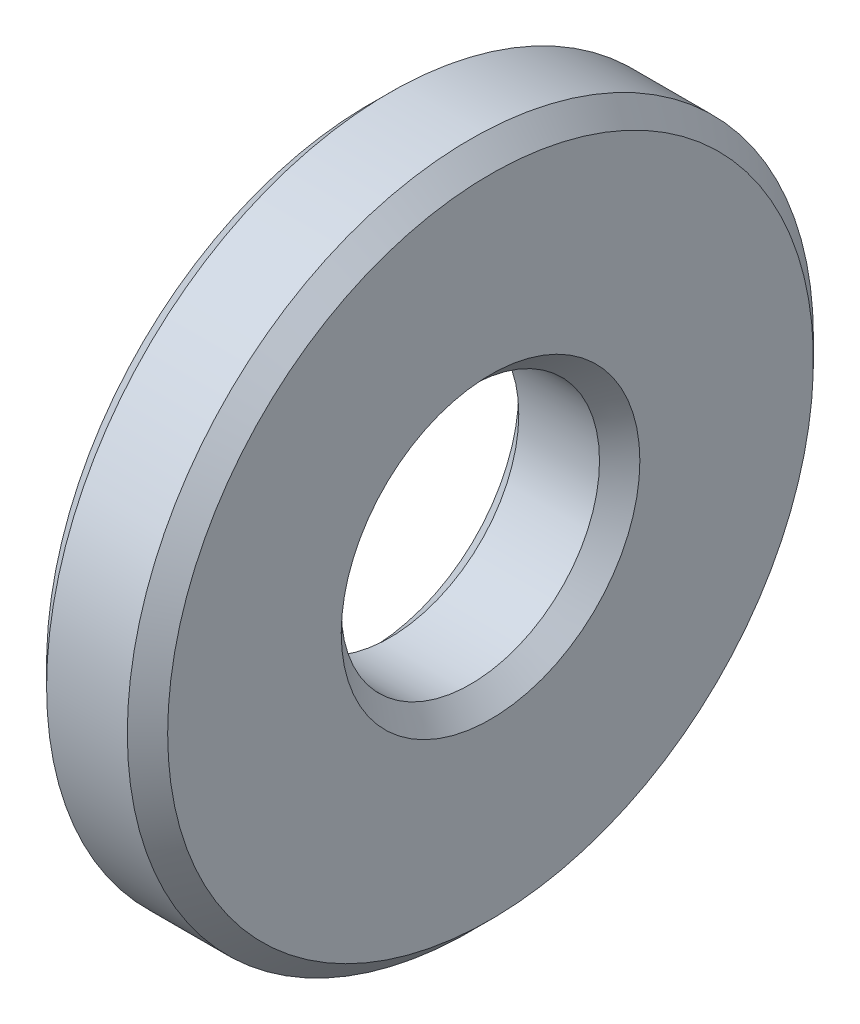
ISO-10303-21;
HEADER;
FILE_DESCRIPTION(('STEP AP214'),'2;1');
FILE_NAME('part.step','',(''),(''),'','','');
FILE_SCHEMA(('AUTOMOTIVE_DESIGN { 1 0 10303 214 1 1 1 1 }'));
ENDSEC;
DATA;
#1=APPLICATION_CONTEXT('core data for automotive mechanical design processes');
#2=APPLICATION_PROTOCOL_DEFINITION('international standard','automotive_design',2000,#1);
#3=PRODUCT_CONTEXT('',#1,'mechanical');
#4=PRODUCT('Part','Part','',(#3));
#5=PRODUCT_RELATED_PRODUCT_CATEGORY('part','',(#4));
#6=PRODUCT_DEFINITION_FORMATION('','',#4);
#7=PRODUCT_DEFINITION_CONTEXT('part definition',#1,'design');
#8=PRODUCT_DEFINITION('design','',#6,#7);
#9=PRODUCT_DEFINITION_SHAPE('','',#8);
#10=(LENGTH_UNIT() NAMED_UNIT(*) SI_UNIT(.MILLI.,.METRE.));
#11=(NAMED_UNIT(*) PLANE_ANGLE_UNIT() SI_UNIT($,.RADIAN.));
#12=(NAMED_UNIT(*) SI_UNIT($,.STERADIAN.) SOLID_ANGLE_UNIT());
#13=UNCERTAINTY_MEASURE_WITH_UNIT(LENGTH_MEASURE(1.E-05),#10,'distance_accuracy_value','');
#14=(GEOMETRIC_REPRESENTATION_CONTEXT(3) GLOBAL_UNCERTAINTY_ASSIGNED_CONTEXT((#13)) GLOBAL_UNIT_ASSIGNED_CONTEXT((#10,
#11,#12)) REPRESENTATION_CONTEXT('',''));
#15=CARTESIAN_POINT('',(0.,0.,0.));
#16=DIRECTION('',(0.,0.,1.));
#17=DIRECTION('',(1.,0.,0.));
#18=AXIS2_PLACEMENT_3D('',#15,#16,#17);
#19=CARTESIAN_POINT('',(0.,3.2,0.));
#20=DIRECTION('',(1.,0.,0.));
#21=DIRECTION('',(0.,0.,-1.));
#22=AXIS2_PLACEMENT_3D('',#19,#20,#21);
#23=PLANE('',#22);
#24=CARTESIAN_POINT('',(0.,0.,0.));
#25=DIRECTION('',(1.,0.,0.));
#26=DIRECTION('',(0.,0.,-1.));
#27=AXIS2_PLACEMENT_3D('',#24,#25,#26);
#28=CIRCLE('',#27,8.);
#29=CARTESIAN_POINT('',(0.,0.,-8.));
#30=VERTEX_POINT('',#29);
#31=EDGE_CURVE('E42',#30,#30,#28,.F.);
#32=ORIENTED_EDGE('',*,*,#31,.T.);
#33=EDGE_LOOP('',(#32));
#34=FACE_BOUND('',#33,.T.);
#35=CARTESIAN_POINT('',(0.,0.,0.));
#36=DIRECTION('',(1.,0.,0.));
#37=DIRECTION('',(0.,0.,-1.));
#38=AXIS2_PLACEMENT_3D('',#35,#36,#37);
#39=CIRCLE('',#38,3.7);
#40=CARTESIAN_POINT('',(0.,0.,-3.7));
#41=VERTEX_POINT('',#40);
#42=EDGE_CURVE('E46',#41,#41,#39,.T.);
#43=ORIENTED_EDGE('',*,*,#42,.T.);
#44=EDGE_LOOP('',(#43));
#45=FACE_BOUND('',#44,.T.);
#46=ADVANCED_FACE('F32',(#34,#45),#23,.F.);
#47=CARTESIAN_POINT('',(0.,0.,0.));
#48=DIRECTION('',(-1.,0.,0.));
#49=DIRECTION('',(0.,0.,1.));
#50=AXIS2_PLACEMENT_3D('',#47,#48,#49);
#51=CYLINDRICAL_SURFACE('',#50,8.5);
#52=CARTESIAN_POINT('',(2.49999999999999,0.,0.));
#53=DIRECTION('',(-1.,0.,0.));
#54=DIRECTION('',(0.,0.,1.));
#55=AXIS2_PLACEMENT_3D('',#52,#53,#54);
#56=CIRCLE('',#55,8.5);
#57=CARTESIAN_POINT('',(2.49999999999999,0.,8.5));
#58=VERTEX_POINT('',#57);
#59=EDGE_CURVE('E57',#58,#58,#56,.T.);
#60=ORIENTED_EDGE('',*,*,#59,.T.);
#61=EDGE_LOOP('',(#60));
#62=FACE_BOUND('',#61,.T.);
#63=CARTESIAN_POINT('',(0.500000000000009,0.,0.));
#64=DIRECTION('',(1.,0.,0.));
#65=DIRECTION('',(0.,0.,-1.));
#66=AXIS2_PLACEMENT_3D('',#63,#64,#65);
#67=CIRCLE('',#66,8.5);
#68=CARTESIAN_POINT('',(0.500000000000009,0.,-8.5));
#69=VERTEX_POINT('',#68);
#70=EDGE_CURVE('E60',#69,#69,#67,.T.);
#71=ORIENTED_EDGE('',*,*,#70,.T.);
#72=EDGE_LOOP('',(#71));
#73=FACE_BOUND('',#72,.T.);
#74=ADVANCED_FACE('F64',(#62,#73),#51,.T.);
#75=CARTESIAN_POINT('',(3.,3.2,0.));
#76=DIRECTION('',(-1.,0.,0.));
#77=DIRECTION('',(0.,0.,1.));
#78=AXIS2_PLACEMENT_3D('',#75,#76,#77);
#79=PLANE('',#78);
#80=CARTESIAN_POINT('',(3.,0.,0.));
#81=DIRECTION('',(-1.,0.,0.));
#82=DIRECTION('',(0.,0.,1.));
#83=AXIS2_PLACEMENT_3D('',#80,#81,#82);
#84=CIRCLE('',#83,8.);
#85=CARTESIAN_POINT('',(3.,0.,8.));
#86=VERTEX_POINT('',#85);
#87=EDGE_CURVE('E51',#86,#86,#84,.F.);
#88=ORIENTED_EDGE('',*,*,#87,.T.);
#89=EDGE_LOOP('',(#88));
#90=FACE_BOUND('',#89,.T.);
#91=CARTESIAN_POINT('',(3.,0.,0.));
#92=DIRECTION('',(-1.,0.,0.));
#93=DIRECTION('',(0.,0.,1.));
#94=AXIS2_PLACEMENT_3D('',#91,#92,#93);
#95=CIRCLE('',#94,3.7);
#96=CARTESIAN_POINT('',(3.,0.,3.7));
#97=VERTEX_POINT('',#96);
#98=EDGE_CURVE('E54',#97,#97,#95,.T.);
#99=ORIENTED_EDGE('',*,*,#98,.T.);
#100=EDGE_LOOP('',(#99));
#101=FACE_BOUND('',#100,.T.);
#102=ADVANCED_FACE('F94',(#90,#101),#79,.F.);
#103=CARTESIAN_POINT('',(0.,0.,0.));
#104=DIRECTION('',(-1.,0.,0.));
#105=DIRECTION('',(0.,0.,1.));
#106=AXIS2_PLACEMENT_3D('',#103,#104,#105);
#107=CYLINDRICAL_SURFACE('',#106,3.2);
#108=CARTESIAN_POINT('',(2.49999999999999,0.,0.));
#109=DIRECTION('',(-1.,0.,0.));
#110=DIRECTION('',(0.,0.,1.));
#111=AXIS2_PLACEMENT_3D('',#108,#109,#110);
#112=CIRCLE('',#111,3.2);
#113=CARTESIAN_POINT('',(2.49999999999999,0.,3.2));
#114=VERTEX_POINT('',#113);
#115=EDGE_CURVE('E10',#114,#114,#112,.F.);
#116=ORIENTED_EDGE('',*,*,#115,.T.);
#117=EDGE_LOOP('',(#116));
#118=FACE_BOUND('',#117,.T.);
#119=CARTESIAN_POINT('',(0.500000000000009,0.,0.));
#120=DIRECTION('',(1.,0.,0.));
#121=DIRECTION('',(0.,0.,-1.));
#122=AXIS2_PLACEMENT_3D('',#119,#120,#121);
#123=CIRCLE('',#122,3.2);
#124=CARTESIAN_POINT('',(0.500000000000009,0.,-3.2));
#125=VERTEX_POINT('',#124);
#126=EDGE_CURVE('E38',#125,#125,#123,.F.);
#127=ORIENTED_EDGE('',*,*,#126,.T.);
#128=EDGE_LOOP('',(#127));
#129=FACE_BOUND('',#128,.T.);
#130=ADVANCED_FACE('F90',(#118,#129),#107,.F.);
#131=CARTESIAN_POINT('',(2.49999999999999,0.,0.));
#132=DIRECTION('',(-1.,0.,0.));
#133=DIRECTION('',(0.,0.,1.));
#134=AXIS2_PLACEMENT_3D('',#131,#132,#133);
#135=CONICAL_SURFACE('',#134,8.5,0.785398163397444);
#136=ORIENTED_EDGE('',*,*,#87,.F.);
#137=EDGE_LOOP('',(#136));
#138=FACE_BOUND('',#137,.T.);
#139=ORIENTED_EDGE('',*,*,#59,.F.);
#140=EDGE_LOOP('',(#139));
#141=FACE_BOUND('',#140,.T.);
#142=ADVANCED_FACE('F70',(#138,#141),#135,.T.);
#143=CARTESIAN_POINT('',(0.,0.,0.));
#144=DIRECTION('',(1.,0.,0.));
#145=DIRECTION('',(0.,0.,-1.));
#146=AXIS2_PLACEMENT_3D('',#143,#144,#145);
#147=CONICAL_SURFACE('',#146,8.,0.785398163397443);
#148=ORIENTED_EDGE('',*,*,#70,.F.);
#149=EDGE_LOOP('',(#148));
#150=FACE_BOUND('',#149,.T.);
#151=ORIENTED_EDGE('',*,*,#31,.F.);
#152=EDGE_LOOP('',(#151));
#153=FACE_BOUND('',#152,.T.);
#154=ADVANCED_FACE('F66',(#150,#153),#147,.T.);
#155=CARTESIAN_POINT('',(3.,0.,0.));
#156=DIRECTION('',(1.,0.,0.));
#157=DIRECTION('',(0.,0.,-1.));
#158=AXIS2_PLACEMENT_3D('',#155,#156,#157);
#159=CONICAL_SURFACE('',#158,3.7,0.785398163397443);
#160=ORIENTED_EDGE('',*,*,#115,.F.);
#161=EDGE_LOOP('',(#160));
#162=FACE_BOUND('',#161,.T.);
#163=ORIENTED_EDGE('',*,*,#98,.F.);
#164=EDGE_LOOP('',(#163));
#165=FACE_BOUND('',#164,.T.);
#166=ADVANCED_FACE('F69',(#162,#165),#159,.F.);
#167=CARTESIAN_POINT('',(0.500000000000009,0.,0.));
#168=DIRECTION('',(-1.,0.,0.));
#169=DIRECTION('',(0.,0.,1.));
#170=AXIS2_PLACEMENT_3D('',#167,#168,#169);
#171=CONICAL_SURFACE('',#170,3.2,0.785398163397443);
#172=ORIENTED_EDGE('',*,*,#42,.F.);
#173=EDGE_LOOP('',(#172));
#174=FACE_BOUND('',#173,.T.);
#175=ORIENTED_EDGE('',*,*,#126,.F.);
#176=EDGE_LOOP('',(#175));
#177=FACE_BOUND('',#176,.T.);
#178=ADVANCED_FACE('F78',(#174,#177),#171,.F.);
#179=CLOSED_SHELL('',(#46,#74,#102,#130,#142,#154,#166,#178));
#180=MANIFOLD_SOLID_BREP('B2',#179);
#181=ADVANCED_BREP_SHAPE_REPRESENTATION('',(#18,#180),#14);
#182=SHAPE_DEFINITION_REPRESENTATION(#9,#181);
ENDSEC;
END-ISO-10303-21;
